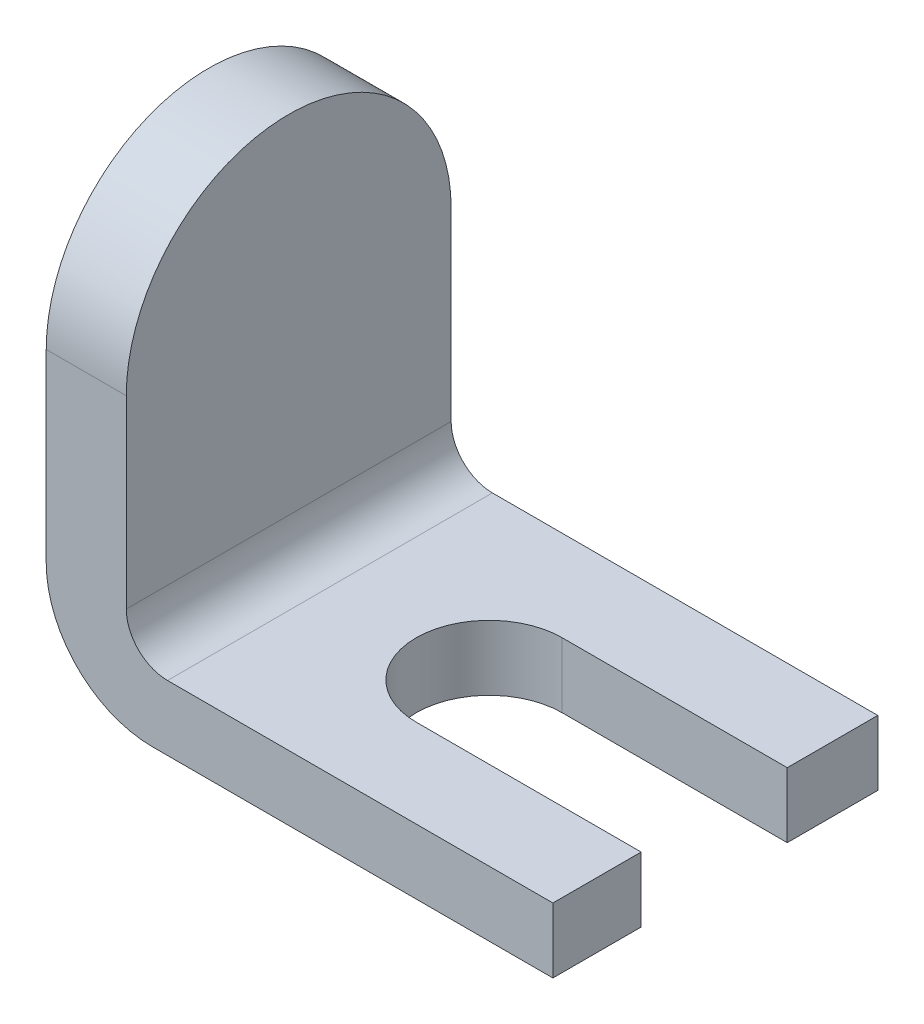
ISO-10303-21;
HEADER;
FILE_DESCRIPTION(('STEP AP214'),'2;1');
FILE_NAME('part.step','',(''),(''),'','','');
FILE_SCHEMA(('AUTOMOTIVE_DESIGN { 1 0 10303 214 1 1 1 1 }'));
ENDSEC;
DATA;
#1=APPLICATION_CONTEXT('core data for automotive mechanical design processes');
#2=APPLICATION_PROTOCOL_DEFINITION('international standard','automotive_design',2000,#1);
#3=PRODUCT_CONTEXT('',#1,'mechanical');
#4=PRODUCT('Part','Part','',(#3));
#5=PRODUCT_RELATED_PRODUCT_CATEGORY('part','',(#4));
#6=PRODUCT_DEFINITION_FORMATION('','',#4);
#7=PRODUCT_DEFINITION_CONTEXT('part definition',#1,'design');
#8=PRODUCT_DEFINITION('design','',#6,#7);
#9=PRODUCT_DEFINITION_SHAPE('','',#8);
#10=(LENGTH_UNIT() NAMED_UNIT(*) SI_UNIT(.MILLI.,.METRE.));
#11=(NAMED_UNIT(*) PLANE_ANGLE_UNIT() SI_UNIT($,.RADIAN.));
#12=(NAMED_UNIT(*) SI_UNIT($,.STERADIAN.) SOLID_ANGLE_UNIT());
#13=UNCERTAINTY_MEASURE_WITH_UNIT(LENGTH_MEASURE(1.E-05),#10,'distance_accuracy_value','');
#14=(GEOMETRIC_REPRESENTATION_CONTEXT(3) GLOBAL_UNCERTAINTY_ASSIGNED_CONTEXT((#13)) GLOBAL_UNIT_ASSIGNED_CONTEXT((#10,
#11,#12)) REPRESENTATION_CONTEXT('',''));
#15=CARTESIAN_POINT('',(0.,0.,0.));
#16=DIRECTION('',(0.,0.,1.));
#17=DIRECTION('',(1.,0.,0.));
#18=AXIS2_PLACEMENT_3D('',#15,#16,#17);
#19=CARTESIAN_POINT('',(124.774241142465,0.,40.005));
#20=DIRECTION('',(-1.,0.,0.));
#21=DIRECTION('',(0.,0.,1.));
#22=AXIS2_PLACEMENT_3D('',#19,#20,#21);
#23=PLANE('',#22);
#24=DIRECTION('',(0.,0.,-1.));
#25=VECTOR('',#24,1.);
#26=CARTESIAN_POINT('',(124.774241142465,0.,40.005));
#27=LINE('',#26,#25);
#28=CARTESIAN_POINT('',(124.774241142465,0.,40.005));
#29=VERTEX_POINT('',#28);
#30=CARTESIAN_POINT('',(124.774241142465,0.,18.2708530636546));
#31=VERTEX_POINT('',#30);
#32=EDGE_CURVE('E143',#29,#31,#27,.T.);
#33=ORIENTED_EDGE('',*,*,#32,.T.);
#34=DIRECTION('',(0.,-1.,0.));
#35=VECTOR('',#34,1.);
#36=CARTESIAN_POINT('',(124.774241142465,317.539040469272,18.2708530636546));
#37=LINE('',#36,#35);
#38=CARTESIAN_POINT('',(124.774241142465,15.9997145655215,18.2708530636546));
#39=VERTEX_POINT('',#38);
#40=EDGE_CURVE('E127',#39,#31,#37,.T.);
#41=ORIENTED_EDGE('',*,*,#40,.F.);
#42=DIRECTION('',(0.,0.,-1.));
#43=VECTOR('',#42,1.);
#44=CARTESIAN_POINT('',(124.774241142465,15.9997145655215,40.005));
#45=LINE('',#44,#43);
#46=CARTESIAN_POINT('',(124.774241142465,15.9997145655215,40.005));
#47=VERTEX_POINT('',#46);
#48=EDGE_CURVE('E144',#47,#39,#45,.T.);
#49=ORIENTED_EDGE('',*,*,#48,.F.);
#50=DIRECTION('',(0.,1.,0.));
#51=VECTOR('',#50,1.);
#52=CARTESIAN_POINT('',(124.774241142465,0.,40.005));
#53=LINE('',#52,#51);
#54=EDGE_CURVE('E200',#29,#47,#53,.T.);
#55=ORIENTED_EDGE('',*,*,#54,.F.);
#56=EDGE_LOOP('',(#33,#41,#49,#55));
#57=FACE_BOUND('',#56,.T.);
#58=ADVANCED_FACE('F30',(#57),#23,.F.);
#59=CARTESIAN_POINT('',(19.7115706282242,71.6555885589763,0.));
#60=DIRECTION('',(-1.,0.,0.));
#61=DIRECTION('',(0.,0.,1.));
#62=AXIS2_PLACEMENT_3D('',#59,#60,#61);
#63=CYLINDRICAL_SURFACE('',#62,40.005);
#64=DIRECTION('',(1.,0.,0.));
#65=VECTOR('',#64,1.);
#66=CARTESIAN_POINT('',(19.7115706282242,71.6555885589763,40.005));
#67=LINE('',#66,#65);
#68=CARTESIAN_POINT('',(19.7115706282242,71.6555885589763,40.005));
#69=VERTEX_POINT('',#68);
#70=CARTESIAN_POINT('',(0.,71.6555885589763,40.005));
#71=VERTEX_POINT('',#70);
#72=EDGE_CURVE('E159',#69,#71,#67,.F.);
#73=ORIENTED_EDGE('',*,*,#72,.F.);
#74=CARTESIAN_POINT('',(19.7115706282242,71.6555885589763,0.));
#75=DIRECTION('',(-1.,0.,0.));
#76=DIRECTION('',(0.,0.,1.));
#77=AXIS2_PLACEMENT_3D('',#74,#75,#76);
#78=CIRCLE('',#77,40.005);
#79=CARTESIAN_POINT('',(19.7115706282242,71.6555885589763,-40.005));
#80=VERTEX_POINT('',#79);
#81=EDGE_CURVE('E53',#80,#69,#78,.F.);
#82=ORIENTED_EDGE('',*,*,#81,.F.);
#83=DIRECTION('',(-1.,0.,0.));
#84=VECTOR('',#83,1.);
#85=CARTESIAN_POINT('',(29.8715706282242,71.6555885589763,-40.005));
#86=LINE('',#85,#84);
#87=CARTESIAN_POINT('',(0.,71.6555885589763,-40.005));
#88=VERTEX_POINT('',#87);
#89=EDGE_CURVE('E162',#88,#80,#86,.F.);
#90=ORIENTED_EDGE('',*,*,#89,.F.);
#91=CARTESIAN_POINT('',(0.,71.6555885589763,0.));
#92=DIRECTION('',(1.,0.,0.));
#93=DIRECTION('',(0.,0.,-1.));
#94=AXIS2_PLACEMENT_3D('',#91,#92,#93);
#95=CIRCLE('',#94,40.005);
#96=EDGE_CURVE('E165',#71,#88,#95,.F.);
#97=ORIENTED_EDGE('',*,*,#96,.F.);
#98=EDGE_LOOP('',(#73,#82,#90,#97));
#99=FACE_BOUND('',#98,.T.);
#100=ADVANCED_FACE('F32',(#99),#63,.T.);
#101=CARTESIAN_POINT('',(29.8715706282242,26.1597145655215,40.005));
#102=DIRECTION('',(0.,0.,-1.));
#103=DIRECTION('',(-1.,0.,0.));
#104=AXIS2_PLACEMENT_3D('',#101,#102,#103);
#105=CYLINDRICAL_SURFACE('',#104,10.16);
#106=CARTESIAN_POINT('',(29.8715706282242,26.1597145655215,-40.005));
#107=DIRECTION('',(0.,0.,-1.));
#108=DIRECTION('',(1.,0.,0.));
#109=AXIS2_PLACEMENT_3D('',#106,#107,#108);
#110=CIRCLE('',#109,10.16);
#111=CARTESIAN_POINT('',(29.8715706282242,15.9997145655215,-40.005));
#112=VERTEX_POINT('',#111);
#113=CARTESIAN_POINT('',(19.7115706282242,26.1597145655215,-40.005));
#114=VERTEX_POINT('',#113);
#115=EDGE_CURVE('E186',#112,#114,#110,.T.);
#116=ORIENTED_EDGE('',*,*,#115,.T.);
#117=DIRECTION('',(0.,0.,-1.));
#118=VECTOR('',#117,1.);
#119=CARTESIAN_POINT('',(19.7115706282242,26.1597145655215,40.005));
#120=LINE('',#119,#118);
#121=CARTESIAN_POINT('',(19.7115706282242,26.1597145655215,40.005));
#122=VERTEX_POINT('',#121);
#123=EDGE_CURVE('E156',#122,#114,#120,.T.);
#124=ORIENTED_EDGE('',*,*,#123,.F.);
#125=CARTESIAN_POINT('',(29.8715706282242,26.1597145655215,40.005));
#126=DIRECTION('',(0.,0.,-1.));
#127=DIRECTION('',(1.,0.,0.));
#128=AXIS2_PLACEMENT_3D('',#125,#126,#127);
#129=CIRCLE('',#128,10.16);
#130=CARTESIAN_POINT('',(29.8715706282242,15.9997145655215,40.005));
#131=VERTEX_POINT('',#130);
#132=EDGE_CURVE('E187',#131,#122,#129,.T.);
#133=ORIENTED_EDGE('',*,*,#132,.F.);
#134=DIRECTION('',(0.,0.,-1.));
#135=VECTOR('',#134,1.);
#136=CARTESIAN_POINT('',(29.8715706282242,15.9997145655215,40.005));
#137=LINE('',#136,#135);
#138=EDGE_CURVE('E204',#131,#112,#137,.T.);
#139=ORIENTED_EDGE('',*,*,#138,.T.);
#140=EDGE_LOOP('',(#116,#124,#133,#139));
#141=FACE_BOUND('',#140,.T.);
#142=ADVANCED_FACE('F227',(#141),#105,.F.);
#143=CARTESIAN_POINT('',(19.7115706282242,26.1597145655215,40.005));
#144=DIRECTION('',(-1.,0.,0.));
#145=DIRECTION('',(0.,0.,1.));
#146=AXIS2_PLACEMENT_3D('',#143,#144,#145);
#147=PLANE('',#146);
#148=DIRECTION('',(0.,1.,0.));
#149=VECTOR('',#148,1.);
#150=CARTESIAN_POINT('',(19.7115706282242,26.1597145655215,-40.005));
#151=LINE('',#150,#149);
#152=EDGE_CURVE('E207',#114,#80,#151,.T.);
#153=ORIENTED_EDGE('',*,*,#152,.T.);
#154=ORIENTED_EDGE('',*,*,#81,.T.);
#155=DIRECTION('',(0.,1.,0.));
#156=VECTOR('',#155,1.);
#157=CARTESIAN_POINT('',(19.7115706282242,26.1597145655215,40.005));
#158=LINE('',#157,#156);
#159=EDGE_CURVE('E190',#122,#69,#158,.T.);
#160=ORIENTED_EDGE('',*,*,#159,.F.);
#161=ORIENTED_EDGE('',*,*,#123,.T.);
#162=EDGE_LOOP('',(#153,#154,#160,#161));
#163=FACE_BOUND('',#162,.T.);
#164=ADVANCED_FACE('F229',(#163),#147,.F.);
#165=CARTESIAN_POINT('',(0.,111.660588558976,40.005));
#166=DIRECTION('',(1.,0.,0.));
#167=DIRECTION('',(0.,0.,-1.));
#168=AXIS2_PLACEMENT_3D('',#165,#166,#167);
#169=PLANE('',#168);
#170=DIRECTION('',(0.,-1.,0.));
#171=VECTOR('',#170,1.);
#172=CARTESIAN_POINT('',(0.,111.660588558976,40.005));
#173=LINE('',#172,#171);
#174=CARTESIAN_POINT('',(0.,26.1597145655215,40.005));
#175=VERTEX_POINT('',#174);
#176=EDGE_CURVE('E194',#71,#175,#173,.T.);
#177=ORIENTED_EDGE('',*,*,#176,.F.);
#178=ORIENTED_EDGE('',*,*,#96,.T.);
#179=DIRECTION('',(0.,-1.,0.));
#180=VECTOR('',#179,1.);
#181=CARTESIAN_POINT('',(0.,111.660588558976,-40.005));
#182=LINE('',#181,#180);
#183=CARTESIAN_POINT('',(0.,26.1597145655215,-40.005));
#184=VERTEX_POINT('',#183);
#185=EDGE_CURVE('E210',#88,#184,#182,.T.);
#186=ORIENTED_EDGE('',*,*,#185,.T.);
#187=DIRECTION('',(0.,0.,-1.));
#188=VECTOR('',#187,1.);
#189=CARTESIAN_POINT('',(0.,26.1597145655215,40.005));
#190=LINE('',#189,#188);
#191=EDGE_CURVE('E153',#175,#184,#190,.T.);
#192=ORIENTED_EDGE('',*,*,#191,.F.);
#193=EDGE_LOOP('',(#177,#178,#186,#192));
#194=FACE_BOUND('',#193,.T.);
#195=ADVANCED_FACE('F246',(#194),#169,.F.);
#196=CARTESIAN_POINT('',(26.1597145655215,26.1597145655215,40.005));
#197=DIRECTION('',(0.,0.,-1.));
#198=DIRECTION('',(-1.,0.,0.));
#199=AXIS2_PLACEMENT_3D('',#196,#197,#198);
#200=CYLINDRICAL_SURFACE('',#199,26.1597145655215);
#201=CARTESIAN_POINT('',(26.1597145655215,26.1597145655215,-40.005));
#202=DIRECTION('',(0.,0.,1.));
#203=DIRECTION('',(1.,0.,0.));
#204=AXIS2_PLACEMENT_3D('',#201,#202,#203);
#205=CIRCLE('',#204,26.1597145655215);
#206=CARTESIAN_POINT('',(26.1597145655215,0.,-40.005));
#207=VERTEX_POINT('',#206);
#208=EDGE_CURVE('E212',#184,#207,#205,.T.);
#209=ORIENTED_EDGE('',*,*,#208,.T.);
#210=DIRECTION('',(0.,0.,-1.));
#211=VECTOR('',#210,1.);
#212=CARTESIAN_POINT('',(26.1597145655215,0.,40.005));
#213=LINE('',#212,#211);
#214=CARTESIAN_POINT('',(26.1597145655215,0.,40.005));
#215=VERTEX_POINT('',#214);
#216=EDGE_CURVE('E147',#215,#207,#213,.T.);
#217=ORIENTED_EDGE('',*,*,#216,.F.);
#218=CARTESIAN_POINT('',(26.1597145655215,26.1597145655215,40.005));
#219=DIRECTION('',(0.,0.,1.));
#220=DIRECTION('',(1.,0.,0.));
#221=AXIS2_PLACEMENT_3D('',#218,#219,#220);
#222=CIRCLE('',#221,26.1597145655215);
#223=EDGE_CURVE('E196',#175,#215,#222,.T.);
#224=ORIENTED_EDGE('',*,*,#223,.F.);
#225=ORIENTED_EDGE('',*,*,#191,.T.);
#226=EDGE_LOOP('',(#209,#217,#224,#225));
#227=FACE_BOUND('',#226,.T.);
#228=ADVANCED_FACE('F243',(#227),#200,.T.);
#229=CARTESIAN_POINT('',(26.1597145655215,0.,40.005));
#230=DIRECTION('',(0.,1.,0.));
#231=DIRECTION('',(0.,0.,1.));
#232=AXIS2_PLACEMENT_3D('',#229,#230,#231);
#233=PLANE('',#232);
#234=CARTESIAN_POINT('',(69.3612545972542,0.,0.280098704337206));
#235=DIRECTION('',(0.,1.,0.));
#236=DIRECTION('',(0.,0.,1.));
#237=AXIS2_PLACEMENT_3D('',#234,#235,#236);
#238=CIRCLE('',#237,17.9907543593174);
#239=CARTESIAN_POINT('',(69.3612545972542,0.,-17.7106556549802));
#240=VERTEX_POINT('',#239);
#241=CARTESIAN_POINT('',(69.3612545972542,0.,18.2708530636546));
#242=VERTEX_POINT('',#241);
#243=EDGE_CURVE('E126',#240,#242,#238,.T.);
#244=ORIENTED_EDGE('',*,*,#243,.T.);
#245=DIRECTION('',(1.,0.,0.));
#246=VECTOR('',#245,1.);
#247=CARTESIAN_POINT('',(26.1597145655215,0.,18.2708530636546));
#248=LINE('',#247,#246);
#249=EDGE_CURVE('E179',#242,#31,#248,.T.);
#250=ORIENTED_EDGE('',*,*,#249,.T.);
#251=ORIENTED_EDGE('',*,*,#32,.F.);
#252=DIRECTION('',(1.,0.,0.));
#253=VECTOR('',#252,1.);
#254=CARTESIAN_POINT('',(26.1597145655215,0.,40.005));
#255=LINE('',#254,#253);
#256=EDGE_CURVE('E198',#215,#29,#255,.T.);
#257=ORIENTED_EDGE('',*,*,#256,.F.);
#258=ORIENTED_EDGE('',*,*,#216,.T.);
#259=DIRECTION('',(1.,0.,0.));
#260=VECTOR('',#259,1.);
#261=CARTESIAN_POINT('',(26.1597145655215,0.,-40.005));
#262=LINE('',#261,#260);
#263=CARTESIAN_POINT('',(124.774241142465,0.,-40.005));
#264=VERTEX_POINT('',#263);
#265=EDGE_CURVE('E141',#207,#264,#262,.T.);
#266=ORIENTED_EDGE('',*,*,#265,.T.);
#267=CARTESIAN_POINT('',(124.774241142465,0.,-17.7106556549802));
#268=VERTEX_POINT('',#267);
#269=EDGE_CURVE('E133',#268,#264,#27,.T.);
#270=ORIENTED_EDGE('',*,*,#269,.F.);
#271=DIRECTION('',(-1.,0.,0.));
#272=VECTOR('',#271,1.);
#273=CARTESIAN_POINT('',(26.1597145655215,0.,-17.7106556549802));
#274=LINE('',#273,#272);
#275=EDGE_CURVE('E119',#268,#240,#274,.T.);
#276=ORIENTED_EDGE('',*,*,#275,.T.);
#277=EDGE_LOOP('',(#244,#250,#251,#257,#258,#266,#270,#276));
#278=FACE_BOUND('',#277,.T.);
#279=ADVANCED_FACE('F138',(#278),#233,.F.);
#280=CARTESIAN_POINT('',(124.774241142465,15.9997145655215,-17.7106556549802));
#281=VERTEX_POINT('',#280);
#282=CARTESIAN_POINT('',(124.774241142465,15.9997145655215,-40.005));
#283=VERTEX_POINT('',#282);
#284=EDGE_CURVE('E135',#281,#283,#45,.T.);
#285=ORIENTED_EDGE('',*,*,#284,.F.);
#286=DIRECTION('',(0.,-1.,0.));
#287=VECTOR('',#286,1.);
#288=CARTESIAN_POINT('',(124.774241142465,317.539040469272,-17.7106556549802));
#289=LINE('',#288,#287);
#290=EDGE_CURVE('E45',#281,#268,#289,.T.);
#291=ORIENTED_EDGE('',*,*,#290,.T.);
#292=ORIENTED_EDGE('',*,*,#269,.T.);
#293=DIRECTION('',(0.,1.,0.));
#294=VECTOR('',#293,1.);
#295=CARTESIAN_POINT('',(124.774241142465,0.,-40.005));
#296=LINE('',#295,#294);
#297=EDGE_CURVE('E215',#264,#283,#296,.T.);
#298=ORIENTED_EDGE('',*,*,#297,.T.);
#299=EDGE_LOOP('',(#285,#291,#292,#298));
#300=FACE_BOUND('',#299,.T.);
#301=ADVANCED_FACE('F131',(#300),#23,.F.);
#302=CARTESIAN_POINT('',(29.8715706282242,15.9997145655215,40.005));
#303=DIRECTION('',(0.,-1.,0.));
#304=DIRECTION('',(0.,0.,-1.));
#305=AXIS2_PLACEMENT_3D('',#302,#303,#304);
#306=PLANE('',#305);
#307=ORIENTED_EDGE('',*,*,#48,.T.);
#308=DIRECTION('',(-1.,0.,0.));
#309=VECTOR('',#308,1.);
#310=CARTESIAN_POINT('',(29.8715706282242,15.9997145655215,18.2708530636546));
#311=LINE('',#310,#309);
#312=CARTESIAN_POINT('',(69.3612545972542,15.9997145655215,18.2708530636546));
#313=VERTEX_POINT('',#312);
#314=EDGE_CURVE('E11',#39,#313,#311,.T.);
#315=ORIENTED_EDGE('',*,*,#314,.T.);
#316=CARTESIAN_POINT('',(69.3612545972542,15.9997145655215,0.280098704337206));
#317=DIRECTION('',(0.,-1.,0.));
#318=DIRECTION('',(0.,0.,-1.));
#319=AXIS2_PLACEMENT_3D('',#316,#317,#318);
#320=CIRCLE('',#319,17.9907543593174);
#321=CARTESIAN_POINT('',(69.3612545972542,15.9997145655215,-17.7106556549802));
#322=VERTEX_POINT('',#321);
#323=EDGE_CURVE('E38',#313,#322,#320,.T.);
#324=ORIENTED_EDGE('',*,*,#323,.T.);
#325=DIRECTION('',(1.,0.,0.));
#326=VECTOR('',#325,1.);
#327=CARTESIAN_POINT('',(29.8715706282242,15.9997145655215,-17.7106556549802));
#328=LINE('',#327,#326);
#329=EDGE_CURVE('E167',#322,#281,#328,.T.);
#330=ORIENTED_EDGE('',*,*,#329,.T.);
#331=ORIENTED_EDGE('',*,*,#284,.T.);
#332=DIRECTION('',(-1.,0.,0.));
#333=VECTOR('',#332,1.);
#334=CARTESIAN_POINT('',(29.8715706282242,15.9997145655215,-40.005));
#335=LINE('',#334,#333);
#336=EDGE_CURVE('E191',#283,#112,#335,.T.);
#337=ORIENTED_EDGE('',*,*,#336,.T.);
#338=ORIENTED_EDGE('',*,*,#138,.F.);
#339=DIRECTION('',(-1.,0.,0.));
#340=VECTOR('',#339,1.);
#341=CARTESIAN_POINT('',(29.8715706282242,15.9997145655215,40.005));
#342=LINE('',#341,#340);
#343=EDGE_CURVE('E202',#47,#131,#342,.T.);
#344=ORIENTED_EDGE('',*,*,#343,.F.);
#345=EDGE_LOOP('',(#307,#315,#324,#330,#331,#337,#338,#344));
#346=FACE_BOUND('',#345,.T.);
#347=ADVANCED_FACE('F170',(#346),#306,.F.);
#348=CARTESIAN_POINT('',(29.8715706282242,26.1597145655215,40.005));
#349=DIRECTION('',(0.,0.,1.));
#350=DIRECTION('',(1.,0.,0.));
#351=AXIS2_PLACEMENT_3D('',#348,#349,#350);
#352=PLANE('',#351);
#353=ORIENTED_EDGE('',*,*,#159,.T.);
#354=ORIENTED_EDGE('',*,*,#72,.T.);
#355=ORIENTED_EDGE('',*,*,#176,.T.);
#356=ORIENTED_EDGE('',*,*,#223,.T.);
#357=ORIENTED_EDGE('',*,*,#256,.T.);
#358=ORIENTED_EDGE('',*,*,#54,.T.);
#359=ORIENTED_EDGE('',*,*,#343,.T.);
#360=ORIENTED_EDGE('',*,*,#132,.T.);
#361=EDGE_LOOP('',(#353,#354,#355,#356,#357,#358,#359,#360));
#362=FACE_BOUND('',#361,.T.);
#363=ADVANCED_FACE('F231',(#362),#352,.T.);
#364=CARTESIAN_POINT('',(29.8715706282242,26.1597145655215,-40.005));
#365=DIRECTION('',(0.,0.,1.));
#366=DIRECTION('',(1.,0.,0.));
#367=AXIS2_PLACEMENT_3D('',#364,#365,#366);
#368=PLANE('',#367);
#369=ORIENTED_EDGE('',*,*,#185,.F.);
#370=ORIENTED_EDGE('',*,*,#89,.T.);
#371=ORIENTED_EDGE('',*,*,#152,.F.);
#372=ORIENTED_EDGE('',*,*,#115,.F.);
#373=ORIENTED_EDGE('',*,*,#336,.F.);
#374=ORIENTED_EDGE('',*,*,#297,.F.);
#375=ORIENTED_EDGE('',*,*,#265,.F.);
#376=ORIENTED_EDGE('',*,*,#208,.F.);
#377=EDGE_LOOP('',(#369,#370,#371,#372,#373,#374,#375,#376));
#378=FACE_BOUND('',#377,.T.);
#379=ADVANCED_FACE('F225',(#378),#368,.F.);
#380=CARTESIAN_POINT('',(124.774241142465,317.539040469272,18.2708530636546));
#381=DIRECTION('',(0.,0.,1.));
#382=DIRECTION('',(1.,0.,0.));
#383=AXIS2_PLACEMENT_3D('',#380,#381,#382);
#384=PLANE('',#383);
#385=ORIENTED_EDGE('',*,*,#249,.F.);
#386=DIRECTION('',(0.,-1.,0.));
#387=VECTOR('',#386,1.);
#388=CARTESIAN_POINT('',(69.3612545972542,317.539040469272,18.2708530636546));
#389=LINE('',#388,#387);
#390=EDGE_CURVE('E136',#313,#242,#389,.T.);
#391=ORIENTED_EDGE('',*,*,#390,.F.);
#392=ORIENTED_EDGE('',*,*,#314,.F.);
#393=ORIENTED_EDGE('',*,*,#40,.T.);
#394=EDGE_LOOP('',(#385,#391,#392,#393));
#395=FACE_BOUND('',#394,.T.);
#396=ADVANCED_FACE('F176',(#395),#384,.F.);
#397=CARTESIAN_POINT('',(69.3612545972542,317.539040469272,0.280098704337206));
#398=DIRECTION('',(0.,-1.,0.));
#399=DIRECTION('',(0.,0.,-1.));
#400=AXIS2_PLACEMENT_3D('',#397,#398,#399);
#401=CYLINDRICAL_SURFACE('',#400,17.9907543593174);
#402=ORIENTED_EDGE('',*,*,#243,.F.);
#403=DIRECTION('',(0.,-1.,0.));
#404=VECTOR('',#403,1.);
#405=CARTESIAN_POINT('',(69.3612545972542,317.539040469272,-17.7106556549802));
#406=LINE('',#405,#404);
#407=EDGE_CURVE('E122',#322,#240,#406,.T.);
#408=ORIENTED_EDGE('',*,*,#407,.F.);
#409=ORIENTED_EDGE('',*,*,#323,.F.);
#410=ORIENTED_EDGE('',*,*,#390,.T.);
#411=EDGE_LOOP('',(#402,#408,#409,#410));
#412=FACE_BOUND('',#411,.T.);
#413=ADVANCED_FACE('F174',(#412),#401,.F.);
#414=CARTESIAN_POINT('',(69.3612545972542,317.539040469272,-17.7106556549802));
#415=DIRECTION('',(0.,0.,-1.));
#416=DIRECTION('',(-1.,0.,0.));
#417=AXIS2_PLACEMENT_3D('',#414,#415,#416);
#418=PLANE('',#417);
#419=ORIENTED_EDGE('',*,*,#275,.F.);
#420=ORIENTED_EDGE('',*,*,#290,.F.);
#421=ORIENTED_EDGE('',*,*,#329,.F.);
#422=ORIENTED_EDGE('',*,*,#407,.T.);
#423=EDGE_LOOP('',(#419,#420,#421,#422));
#424=FACE_BOUND('',#423,.T.);
#425=ADVANCED_FACE('F120',(#424),#418,.F.);
#426=CLOSED_SHELL('',(#58,#100,#142,#164,#195,#228,#279,#301,#347,#363,#379,#396,#413,#425));
#427=MANIFOLD_SOLID_BREP('B2',#426);
#428=ADVANCED_BREP_SHAPE_REPRESENTATION('',(#18,#427),#14);
#429=SHAPE_DEFINITION_REPRESENTATION(#9,#428);
ENDSEC;
END-ISO-10303-21;
